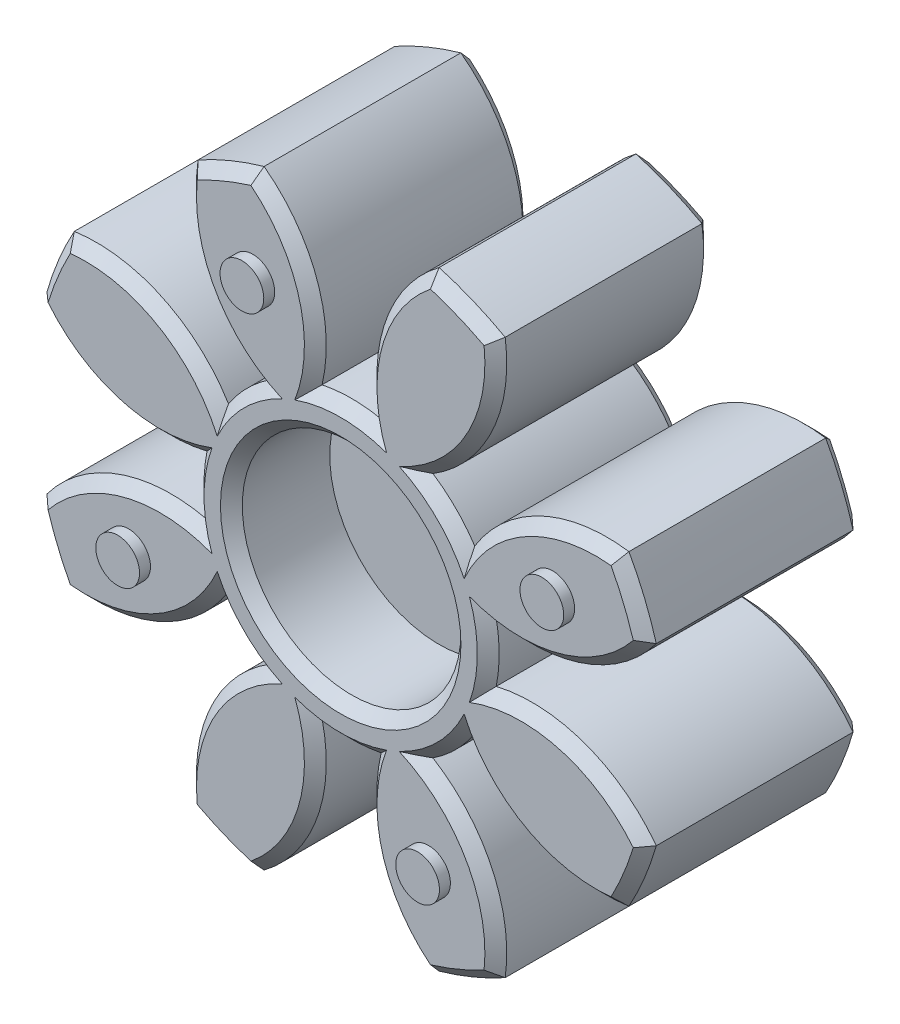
from build123d import *

# Parameters (mm, degrees)
BOSS_EXTRUDE1_START = 0.5
SKETCH1_R           = 7.25
BOSS_EXTRUDE1_DEPTH = 10
SKETCH2_R           = 5
CUT_EXTRUDE1_DEPTH  = 4.5
CUT_EXTRUDE2_START  = -4.5
SKETCH3_R           = 5
CUT_EXTRUDE2_DEPTH  = 4.5
CUT_EXTRUDE3_DEPTH  = 23.792585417
CHAMFER2_SIZE       = 0.5
SKETCH4_R           = 1
BOSS_EXTRUDE2_DEPTH = 0.5
SKETCH5_R           = 1
BOSS_EXTRUDE3_DEPTH = 0.5
CIRPATTERN1_COUNT   = 4


with BuildPart() as part:
    # Sketch1 → Boss-Extrude1 (new body)
    with BuildSketch(Plane.XY.offset(BOSS_EXTRUDE1_START)):
        with BuildLine():
            ThreePointArc((14.482782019, -3.905), (11.295135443, -1.293687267), (7.213064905, -0.730886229))
            ThreePointArc((7.213064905, -0.730886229), (6.698126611, -2.774454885), (5.617221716, -4.583592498))
            ThreePointArc((5.617221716, -4.583592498), (8.901641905, -7.072091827), (13.002125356, -7.479621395))
            ThreePointArc((13.002125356, -7.479621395), (13.858192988, -5.740251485), (14.482782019, -3.905))
        make_face()
        with BuildLine():
            ThreePointArc((7.479621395, -13.002125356), (7.072091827, -8.901641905), (4.583592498, -5.617221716))
            ThreePointArc((4.583592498, -5.617221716), (2.774454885, -6.698126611), (0.730886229, -7.213064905))
            ThreePointArc((0.730886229, -7.213064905), (1.293687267, -11.295135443), (3.905, -14.482782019))
            ThreePointArc((3.905, -14.482782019), (5.740251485, -13.858192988), (7.479621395, -13.002125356))
        make_face()
        with BuildLine():
            ThreePointArc((-3.905, -14.482782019), (-1.293687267, -11.295135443), (-0.730886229, -7.213064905))
            ThreePointArc((-0.730886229, -7.213064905), (-2.774454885, -6.698126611), (-4.583592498, -5.617221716))
            ThreePointArc((-4.583592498, -5.617221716), (-7.072091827, -8.901641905), (-7.479621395, -13.002125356))
            ThreePointArc((-7.479621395, -13.002125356), (-5.740251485, -13.858192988), (-3.905, -14.482782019))
        make_face()
        with BuildLine():
            ThreePointArc((-13.002125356, -7.479621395), (-8.901641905, -7.072091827), (-5.617221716, -4.583592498))
            ThreePointArc((-5.617221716, -4.583592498), (-6.698126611, -2.774454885), (-7.213064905, -0.730886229))
            ThreePointArc((-7.213064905, -0.730886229), (-11.295135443, -1.293687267), (-14.482782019, -3.905))
            ThreePointArc((-14.482782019, -3.905), (-13.858192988, -5.740251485), (-13.002125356, -7.479621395))
        make_face()
        with BuildLine():
            ThreePointArc((-7.213064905, 0.730886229), (-6.698126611, 2.774454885), (-5.617221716, 4.583592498))
            ThreePointArc((-5.617221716, 4.583592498), (-8.901641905, 7.072091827), (-13.002125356, 7.479621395))
            ThreePointArc((-13.002125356, 7.479621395), (-13.858192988, 5.740251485), (-14.482782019, 3.905))
            ThreePointArc((-14.482782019, 3.905), (-11.295135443, 1.293687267), (-7.213064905, 0.730886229))
        make_face()
        with BuildLine():
            ThreePointArc((-4.583592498, 5.617221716), (-2.774454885, 6.698126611), (-0.730886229, 7.213064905))
            ThreePointArc((-0.730886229, 7.213064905), (-1.293687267, 11.295135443), (-3.905, 14.482782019))
            ThreePointArc((-3.905, 14.482782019), (-5.740251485, 13.858192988), (-7.479621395, 13.002125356))
            ThreePointArc((-7.479621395, 13.002125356), (-7.072091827, 8.901641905), (-4.583592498, 5.617221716))
        make_face()
        with BuildLine():
            ThreePointArc((0.730886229, 7.213064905), (2.774454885, 6.698126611), (4.583592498, 5.617221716))
            ThreePointArc((4.583592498, 5.617221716), (7.072091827, 8.901641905), (7.479621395, 13.002125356))
            ThreePointArc((7.479621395, 13.002125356), (5.740251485, 13.858192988), (3.905, 14.482782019))
            ThreePointArc((3.905, 14.482782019), (1.293687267, 11.295135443), (0.730886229, 7.213064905))
        make_face()
        with BuildLine():
            ThreePointArc((5.617221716, 4.583592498), (6.698126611, 2.774454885), (7.213064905, 0.730886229))
            ThreePointArc((7.213064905, 0.730886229), (11.295135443, 1.293687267), (14.482782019, 3.905))
            ThreePointArc((14.482782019, 3.905), (13.858192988, 5.740251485), (13.002125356, 7.479621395))
            ThreePointArc((13.002125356, 7.479621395), (8.901641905, 7.072091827), (5.617221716, 4.583592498))
        make_face()
        Circle(SKETCH1_R)
    extrude(amount=BOSS_EXTRUDE1_DEPTH)

    # Sketch2 → Cut-Extrude1 (cut)
    with BuildSketch(Plane.XY.offset(10.5)):
        Circle(SKETCH2_R)
    extrude(amount=-CUT_EXTRUDE1_DEPTH, mode=Mode.SUBTRACT)

    # Sketch3 → Cut-Extrude2 (cut)
    with BuildSketch(Plane(origin=(0, 0, 0.5), x_dir=(-1, 0, 0), z_dir=(0, 0, -1)).offset(CUT_EXTRUDE2_START)):
        with Locations(Location((0, 0, 0), (0, 0, 180))):
            Circle(SKETCH3_R)
    extrude(amount=CUT_EXTRUDE2_DEPTH, mode=Mode.SUBTRACT)

    # Sketch6 → Cut-Extrude3 (cut, through all)
    with BuildSketch(Plane.XY.offset(10.5)):
        with BuildLine():
            ThreePointArc((5.617221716, -4.583592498), (8.901641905, -7.072091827), (13.002125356, -7.479621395))
            ThreePointArc((13.002125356, -7.479621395), (13.858192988, -5.740251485), (14.482782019, -3.905))
            ThreePointArc((14.482782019, -3.905), (11.295135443, -1.293687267), (7.213064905, -0.730886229))
            ThreePointArc((7.213064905, -0.730886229), (7.25, 0), (7.213064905, 0.730886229))
            ThreePointArc((7.213064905, 0.730886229), (11.295135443, 1.293687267), (14.482782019, 3.905))
            ThreePointArc((14.482782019, 3.905), (13.858192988, 5.740251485), (13.002125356, 7.479621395))
            ThreePointArc((13.002125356, 7.479621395), (8.901641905, 7.072091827), (5.617221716, 4.583592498))
            ThreePointArc((5.617221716, 4.583592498), (5.126524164, 5.126524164), (4.583592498, 5.617221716))
            ThreePointArc((4.583592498, 5.617221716), (7.072091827, 8.901641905), (7.479621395, 13.002125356))
            ThreePointArc((7.479621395, 13.002125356), (5.740251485, 13.858192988), (3.905, 14.482782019))
            ThreePointArc((3.905, 14.482782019), (1.293687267, 11.295135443), (0.730886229, 7.213064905))
            ThreePointArc((0.730886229, 7.213064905), (0, 7.25), (-0.730886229, 7.213064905))
            ThreePointArc((-0.730886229, 7.213064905), (-1.293687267, 11.295135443), (-3.905, 14.482782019))
            ThreePointArc((-3.905, 14.482782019), (-5.740251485, 13.858192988), (-7.479621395, 13.002125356))
            ThreePointArc((-7.479621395, 13.002125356), (-7.072091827, 8.901641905), (-4.583592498, 5.617221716))
            ThreePointArc((-4.583592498, 5.617221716), (-5.126524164, 5.126524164), (-5.617221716, 4.583592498))
            ThreePointArc((-5.617221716, 4.583592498), (-8.901641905, 7.072091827), (-13.002125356, 7.479621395))
            ThreePointArc((-13.002125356, 7.479621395), (-13.858192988, 5.740251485), (-14.482782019, 3.905))
            ThreePointArc((-14.482782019, 3.905), (-11.295135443, 1.293687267), (-7.213064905, 0.730886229))
            ThreePointArc((-7.213064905, 0.730886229), (-7.25, 0), (-7.213064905, -0.730886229))
            ThreePointArc((-7.213064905, -0.730886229), (-11.295135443, -1.293687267), (-14.482782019, -3.905))
            ThreePointArc((-14.482782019, -3.905), (-13.858192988, -5.740251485), (-13.002125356, -7.479621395))
            ThreePointArc((-13.002125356, -7.479621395), (-8.901641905, -7.072091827), (-5.617221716, -4.583592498))
            ThreePointArc((-5.617221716, -4.583592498), (-5.126524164, -5.126524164), (-4.583592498, -5.617221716))
            ThreePointArc((-4.583592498, -5.617221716), (-7.072091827, -8.901641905), (-7.479621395, -13.002125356))
            ThreePointArc((-7.479621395, -13.002125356), (-5.740251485, -13.858192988), (-3.905, -14.482782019))
            ThreePointArc((-3.905, -14.482782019), (-1.293687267, -11.295135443), (-0.730886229, -7.213064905))
            ThreePointArc((-0.730886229, -7.213064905), (0, -7.25), (0.730886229, -7.213064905))
            ThreePointArc((0.730886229, -7.213064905), (1.293687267, -11.295135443), (3.905, -14.482782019))
            ThreePointArc((3.905, -14.482782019), (5.740251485, -13.858192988), (7.479621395, -13.002125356))
            ThreePointArc((7.479621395, -13.002125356), (7.072091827, -8.901641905), (4.583592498, -5.617221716))
            ThreePointArc((4.583592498, -5.617221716), (5.126524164, -5.126524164), (5.617221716, -4.583592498))
        make_face()
        with BuildLine():
            ThreePointArc((5.632058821, -3.720539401), (8.66484731, -6.426393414), (12.68505668, -7.02419654))
            ThreePointArc((12.68505668, -7.02419654), (13.396253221, -5.548909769), (13.936546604, -4.002832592))
            ThreePointArc((13.936546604, -4.002832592), (10.671118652, -1.582825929), (6.613285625, -1.351648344))
            ThreePointArc((6.613285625, -1.351648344), (6.75, 0), (6.613285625, 1.351648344))
            ThreePointArc((6.613285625, 1.351648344), (10.671118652, 1.582825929), (13.936546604, 4.002832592))
            ThreePointArc((13.936546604, 4.002832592), (13.396253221, 5.548909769), (12.68505668, 7.02419654))
            ThreePointArc((12.68505668, 7.02419654), (8.66484731, 6.426393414), (5.632058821, 3.720539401))
            ThreePointArc((5.632058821, 3.720539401), (4.772970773, 4.772970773), (3.720539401, 5.632058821))
            ThreePointArc((3.720539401, 5.632058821), (6.426393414, 8.66484731), (7.02419654, 12.68505668))
            ThreePointArc((7.02419654, 12.68505668), (5.548909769, 13.396253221), (4.002832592, 13.936546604))
            ThreePointArc((4.002832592, 13.936546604), (1.582825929, 10.671118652), (1.351648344, 6.613285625))
            ThreePointArc((1.351648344, 6.613285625), (0, 6.75), (-1.351648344, 6.613285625))
            ThreePointArc((-1.351648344, 6.613285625), (-1.582825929, 10.671118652), (-4.002832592, 13.936546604))
            ThreePointArc((-4.002832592, 13.936546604), (-5.548909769, 13.396253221), (-7.02419654, 12.68505668))
            ThreePointArc((-7.02419654, 12.68505668), (-6.426393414, 8.66484731), (-3.720539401, 5.632058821))
            ThreePointArc((-3.720539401, 5.632058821), (-4.772970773, 4.772970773), (-5.632058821, 3.720539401))
            ThreePointArc((-5.632058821, 3.720539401), (-8.66484731, 6.426393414), (-12.68505668, 7.02419654))
            ThreePointArc((-12.68505668, 7.02419654), (-13.396253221, 5.548909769), (-13.936546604, 4.002832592))
            ThreePointArc((-13.936546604, 4.002832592), (-10.671118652, 1.582825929), (-6.613285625, 1.351648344))
            ThreePointArc((-6.613285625, 1.351648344), (-6.75, 0), (-6.613285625, -1.351648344))
            ThreePointArc((-6.613285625, -1.351648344), (-10.671118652, -1.582825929), (-13.936546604, -4.002832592))
            ThreePointArc((-13.936546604, -4.002832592), (-13.396253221, -5.548909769), (-12.68505668, -7.02419654))
            ThreePointArc((-12.68505668, -7.02419654), (-8.66484731, -6.426393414), (-5.632058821, -3.720539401))
            ThreePointArc((-5.632058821, -3.720539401), (-4.772970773, -4.772970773), (-3.720539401, -5.632058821))
            ThreePointArc((-3.720539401, -5.632058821), (-6.426393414, -8.66484731), (-7.02419654, -12.68505668))
            ThreePointArc((-7.02419654, -12.68505668), (-5.548909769, -13.396253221), (-4.002832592, -13.936546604))
            ThreePointArc((-4.002832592, -13.936546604), (-1.582825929, -10.671118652), (-1.351648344, -6.613285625))
            ThreePointArc((-1.351648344, -6.613285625), (0, -6.75), (1.351648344, -6.613285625))
            ThreePointArc((1.351648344, -6.613285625), (1.582825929, -10.671118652), (4.002832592, -13.936546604))
            ThreePointArc((4.002832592, -13.936546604), (5.548909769, -13.396253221), (7.02419654, -12.68505668))
            ThreePointArc((7.02419654, -12.68505668), (6.426393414, -8.66484731), (3.720539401, -5.632058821))
            ThreePointArc((3.720539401, -5.632058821), (4.772970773, -4.772970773), (5.632058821, -3.720539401))
        make_face(mode=Mode.SUBTRACT)
    extrude(amount=-CUT_EXTRUDE3_DEPTH, mode=Mode.SUBTRACT)

    # Chamfer2
    chamfer2_edges = [part.edges().sort_by_distance(p)[0] for p in [
        (-6.426393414, -8.66484731, 0.5),
        (-4.772970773, -4.772970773, 0.5),
        (-8.66484731, -6.426393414, 0.5),
        (-13.396253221, -5.548909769, 0.5),
        (-10.671118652, -1.582825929, 0.5),
        (-6.75, 0, 0.5),
        (-10.671118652, 1.582825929, 0.5),
        (-13.396253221, 5.548909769, 0.5),
        (-8.66484731, 6.426393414, 0.5),
        (-4.772970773, 4.772970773, 0.5),
        (-6.426393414, 8.66484731, 0.5),
        (-5.548909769, 13.396253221, 0.5),
        (-1.582825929, 10.671118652, 0.5),
        (0, 6.75, 0.5),
        (1.582825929, 10.671118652, 0.5),
        (5.548909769, 13.396253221, 0.5),
        (6.426393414, 8.66484731, 0.5),
        (4.772970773, 4.772970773, 0.5),
        (8.66484731, 6.426393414, 0.5),
        (13.396253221, 5.548909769, 0.5),
        (10.671118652, 1.582825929, 0.5),
        (6.75, 0, 0.5),
        (10.671118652, -1.582825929, 0.5),
        (13.396253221, -5.548909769, 0.5),
        (8.66484731, -6.426393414, 0.5),
        (4.772970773, -4.772970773, 0.5),
        (6.426393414, -8.66484731, 0.5),
        (5.548909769, -13.396253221, 0.5),
        (1.582825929, -10.671118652, 0.5),
        (0, -6.75, 0.5),
        (-1.582825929, -10.671118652, 0.5),
        (-5.548909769, -13.396253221, 0.5),
        (-5, 0, 0.5),
        (-6.426393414, -8.66484731, 10.5),
        (-4.772970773, -4.772970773, 10.5),
        (-8.66484731, -6.426393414, 10.5),
        (-13.396253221, -5.548909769, 10.5),
        (-10.671118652, -1.582825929, 10.5),
        (-6.75, 0, 10.5),
        (-10.671118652, 1.582825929, 10.5),
        (-13.396253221, 5.548909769, 10.5),
        (-8.66484731, 6.426393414, 10.5),
        (-4.772970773, 4.772970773, 10.5),
        (-6.426393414, 8.66484731, 10.5),
        (-5.548909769, 13.396253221, 10.5),
        (-1.582825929, 10.671118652, 10.5),
        (0, 6.75, 10.5),
        (1.582825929, 10.671118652, 10.5),
        (5.548909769, 13.396253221, 10.5),
        (6.426393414, 8.66484731, 10.5),
        (4.772970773, 4.772970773, 10.5),
        (8.66484731, 6.426393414, 10.5),
        (13.396253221, 5.548909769, 10.5),
        (10.671118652, 1.582825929, 10.5),
        (6.75, 0, 10.5),
        (10.671118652, -1.582825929, 10.5),
        (13.396253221, -5.548909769, 10.5),
        (8.66484731, -6.426393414, 10.5),
        (4.772970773, -4.772970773, 10.5),
        (6.426393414, -8.66484731, 10.5),
        (5.548909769, -13.396253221, 10.5),
        (1.582825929, -10.671118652, 10.5),
        (0, -6.75, 10.5),
        (-1.582825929, -10.671118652, 10.5),
        (-5.548909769, -13.396253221, 10.5),
        (-5, 0, 10.5),
    ]]
    chamfer(chamfer2_edges, length=CHAMFER2_SIZE)

    # Sketch4 → Boss-Extrude2 (add)
    with BuildSketch(Plane(origin=(0, 0, 0.5), x_dir=(-1, 0, 0), z_dir=(0, 0, -1))):
        with Locations(Location((9.700735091, 4.01817604, 0), (0, 0, 180))):
            Circle(SKETCH4_R)
    boss_extrude2 = extrude(amount=BOSS_EXTRUDE2_DEPTH)

    # Sketch5 → Boss-Extrude3 (add)
    with BuildSketch(Plane.XY.offset(10.5)):
        with Locations((-9.700735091, -4.01817604)):
            Circle(SKETCH5_R)
    boss_extrude3 = extrude(amount=BOSS_EXTRUDE3_DEPTH)

    # CirPattern1: Boss-Extrude2, Boss-Extrude3 ×4 about axis
    cirpattern1_axis = Axis((0, 0, 0), (0, 0, 1))
    add([boss_extrude2.rotate(cirpattern1_axis, i * 360 / CIRPATTERN1_COUNT) for i in range(1, CIRPATTERN1_COUNT)])
    add([boss_extrude3.rotate(cirpattern1_axis, i * 360 / CIRPATTERN1_COUNT) for i in range(1, CIRPATTERN1_COUNT)])


solid = part.part
